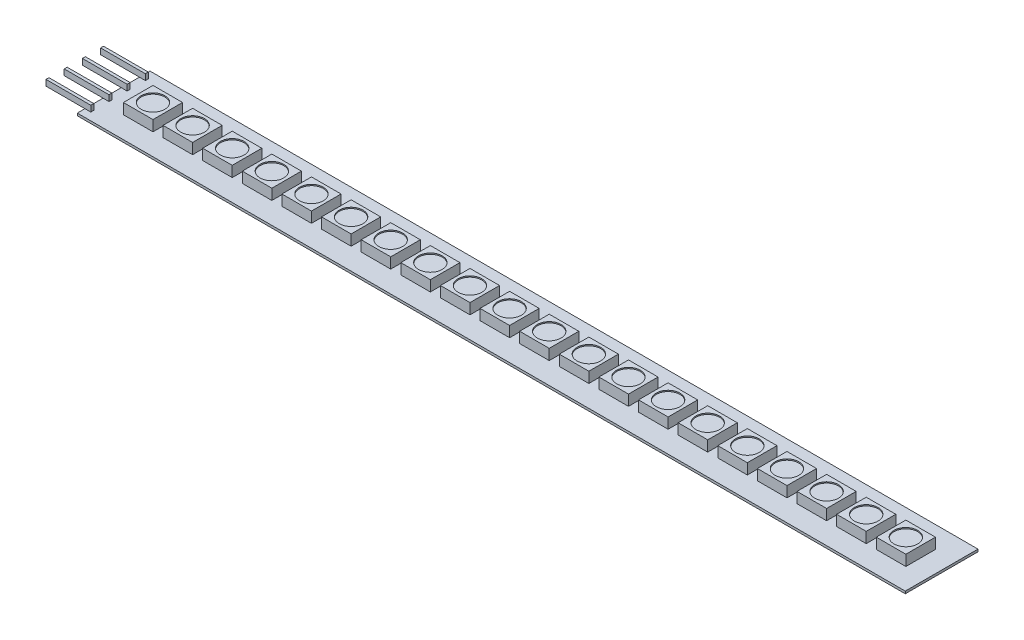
from build123d import *

# Parameters (mm, degrees)
SKETCH_1_W          = 140
SKETCH_1_H          = 12.3
EXTRUDE_1_DEPTH     = 0.4
SKETCH_2_W          = 5
SKETCH_2_H          = 5
EXTRUDE_2_DEPTH     = 1.8
SKETCH_3_R          = 2
CUT_EXTRUDE_1_DEPTH = 0.2
SKETCH_4_W          = 6.57602845
SKETCH_4_H          = 0.5
SKETCH_4_W_2        = 1
EXTRUDE_3_DEPTH     = 1


with BuildPart() as part:
    # Sketch 1 → Extrude 1 (new body)
    with BuildSketch(Plane(origin=(0, 0, 0), x_dir=(1, 0, 0), z_dir=(0, 1, 0))):
        with Locations((70, 6.15)):
            Rectangle(SKETCH_1_W, SKETCH_1_H)
    extrude(amount=EXTRUDE_1_DEPTH)

    # Sketch 2 → Extrude 2 (add)
    with BuildSketch(Plane(origin=(0, 0.4, 0), x_dir=(1, 0, 0), z_dir=(0, 1, 0))):
        with Locations((13.35, 6.15)):
            Rectangle(SKETCH_2_W, SKETCH_2_H)
        with Locations((20.05, 6.15)):
            Rectangle(SKETCH_2_W, SKETCH_2_H)
        with Locations((26.75, 6.15)):
            Rectangle(SKETCH_2_W, SKETCH_2_H)
        with Locations((33.45, 6.15)):
            Rectangle(SKETCH_2_W, SKETCH_2_H)
        with Locations((40.15, 6.15)):
            Rectangle(SKETCH_2_W, SKETCH_2_H)
        with Locations((46.85, 6.15)):
            Rectangle(SKETCH_2_W, SKETCH_2_H)
        with Locations((53.55, 6.15)):
            Rectangle(SKETCH_2_W, SKETCH_2_H)
        with Locations((60.25, 6.15)):
            Rectangle(SKETCH_2_W, SKETCH_2_H)
        with Locations((66.95, 6.15)):
            Rectangle(SKETCH_2_W, SKETCH_2_H)
        with Locations((73.65, 6.15)):
            Rectangle(SKETCH_2_W, SKETCH_2_H)
        with Locations((80.35, 6.15)):
            Rectangle(SKETCH_2_W, SKETCH_2_H)
        with Locations((87.05, 6.15)):
            Rectangle(SKETCH_2_W, SKETCH_2_H)
        with Locations((93.75, 6.15)):
            Rectangle(SKETCH_2_W, SKETCH_2_H)
        with Locations((100.45, 6.15)):
            Rectangle(SKETCH_2_W, SKETCH_2_H)
        with Locations((107.15, 6.15)):
            Rectangle(SKETCH_2_W, SKETCH_2_H)
        with Locations((113.85, 6.15)):
            Rectangle(SKETCH_2_W, SKETCH_2_H)
        with Locations((120.55, 6.15)):
            Rectangle(SKETCH_2_W, SKETCH_2_H)
        with Locations((127.25, 6.15)):
            Rectangle(SKETCH_2_W, SKETCH_2_H)
        with Locations((133.95, 6.15)):
            Rectangle(SKETCH_2_W, SKETCH_2_H)
        with Locations((6.65, 6.15)):
            Rectangle(SKETCH_2_W, SKETCH_2_H)
    extrude(amount=EXTRUDE_2_DEPTH)

    # Sketch 3 → Cut-Extrude 1 (cut)
    with BuildSketch(Plane(origin=(0, 2.2, 0), x_dir=(1, 0, 0), z_dir=(0, 1, 0))):
        with Locations(Location((6.65, 6.15, 0), (0, 0, 270))):
            Circle(SKETCH_3_R)
        with Locations(Location((13.35, 6.15, 0), (0, 0, 270))):
            Circle(SKETCH_3_R)
        with Locations(Location((20.05, 6.15, 0), (0, 0, 270))):
            Circle(SKETCH_3_R)
        with Locations(Location((26.75, 6.15, 0), (0, 0, 270))):
            Circle(SKETCH_3_R)
        with Locations(Location((33.45, 6.15, 0), (0, 0, 270))):
            Circle(SKETCH_3_R)
        with Locations(Location((40.15, 6.15, 0), (0, 0, 270))):
            Circle(SKETCH_3_R)
        with Locations(Location((46.85, 6.15, 0), (0, 0, 270))):
            Circle(SKETCH_3_R)
        with Locations(Location((53.55, 6.15, 0), (0, 0, 270))):
            Circle(SKETCH_3_R)
        with Locations(Location((60.25, 6.15, 0), (0, 0, 270))):
            Circle(SKETCH_3_R)
        with Locations(Location((66.95, 6.15, 0), (0, 0, 270))):
            Circle(SKETCH_3_R)
        with Locations(Location((73.65, 6.15, 0), (0, 0, 270))):
            Circle(SKETCH_3_R)
        with Locations(Location((80.35, 6.15, 0), (0, 0, 270))):
            Circle(SKETCH_3_R)
        with Locations(Location((87.05, 6.15, 0), (0, 0, 270))):
            Circle(SKETCH_3_R)
        with Locations(Location((93.75, 6.15, 0), (0, 0, 270))):
            Circle(SKETCH_3_R)
        with Locations(Location((100.45, 6.15, 0), (0, 0, 270))):
            Circle(SKETCH_3_R)
        with Locations(Location((107.15, 6.15, 0), (0, 0, 270))):
            Circle(SKETCH_3_R)
        with Locations(Location((113.85, 6.15, 0), (0, 0, 270))):
            Circle(SKETCH_3_R)
        with Locations(Location((120.55, 6.15, 0), (0, 0, 270))):
            Circle(SKETCH_3_R)
        with Locations(Location((127.25, 6.15, 0), (0, 0, 270))):
            Circle(SKETCH_3_R)
        with Locations(Location((133.95, 6.15, 0), (0, 0, 270))):
            Circle(SKETCH_3_R)
    extrude(amount=-CUT_EXTRUDE_1_DEPTH, mode=Mode.SUBTRACT)

    # Sketch 4 → Extrude 3 (add)
    with BuildSketch(Plane(origin=(0, 0.4, 0), x_dir=(1, 0, 0), z_dir=(0, 1, 0))):
        with Locations((-3.288014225, 7.6875)):
            Rectangle(SKETCH_4_W, SKETCH_4_H)
        with Locations((0.5, 7.6875)):
            Rectangle(SKETCH_4_W_2, SKETCH_4_H)
        with Locations((-3.288014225, 10.7625)):
            Rectangle(SKETCH_4_W, SKETCH_4_H)
        with Locations((0.5, 10.7625)):
            Rectangle(SKETCH_4_W_2, SKETCH_4_H)
        with Locations((-3.288014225, 4.6125)):
            Rectangle(SKETCH_4_W, SKETCH_4_H)
        with Locations((0.5, 4.6125)):
            Rectangle(SKETCH_4_W_2, SKETCH_4_H)
        with Locations((-3.288014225, 1.5375)):
            Rectangle(SKETCH_4_W, SKETCH_4_H)
        with Locations((0.5, 1.5375)):
            Rectangle(SKETCH_4_W_2, SKETCH_4_H)
    extrude(amount=EXTRUDE_3_DEPTH)


solid = part.part
